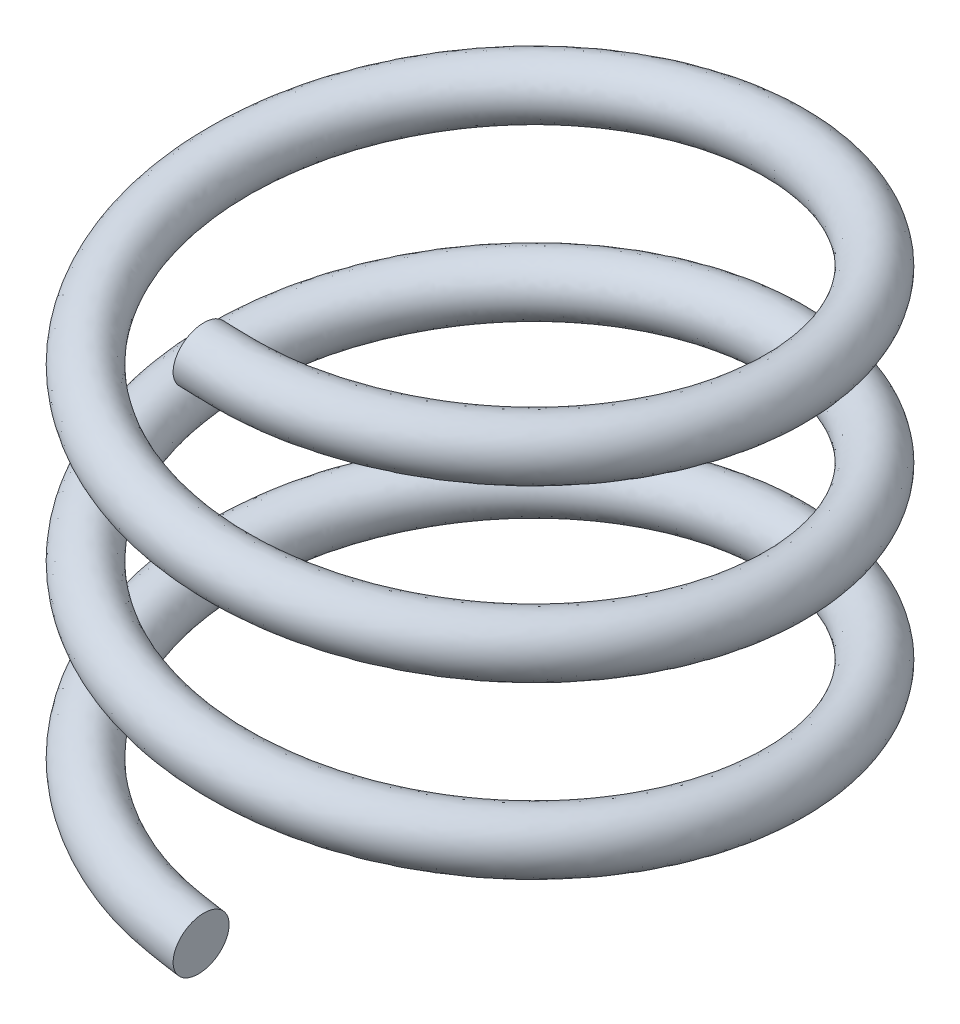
from build123d import *

# Parameters (mm, degrees)
BASE_SWEEP_PITCH  = 2.328333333
BASE_SWEEP_HEIGHT = 6.985
BASE_SWEEP_RADIUS = 3.81
SKETCH2_R         = 0.381


with BuildPart() as part:
    # Base-Sweep: sweep along a helix
    with BuildLine() as base_sweep_path:
        Helix(BASE_SWEEP_PITCH, BASE_SWEEP_HEIGHT, BASE_SWEEP_RADIUS, center=(0, 0, 0), direction=(0, 1, 0), lefthand=True)
    # Sketch2 → Base-Sweep (sweep)
    with BuildSketch(Plane(origin=(0, 0, 3.81), x_dir=(0, 0, 1), z_dir=(-0.9953034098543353, 0.09680455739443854, 0))):
        with Locations((0.000244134, -0.000631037)):
            Circle(SKETCH2_R)
    sweep(path=base_sweep_path.line, is_frenet=True)


solid = part.part
